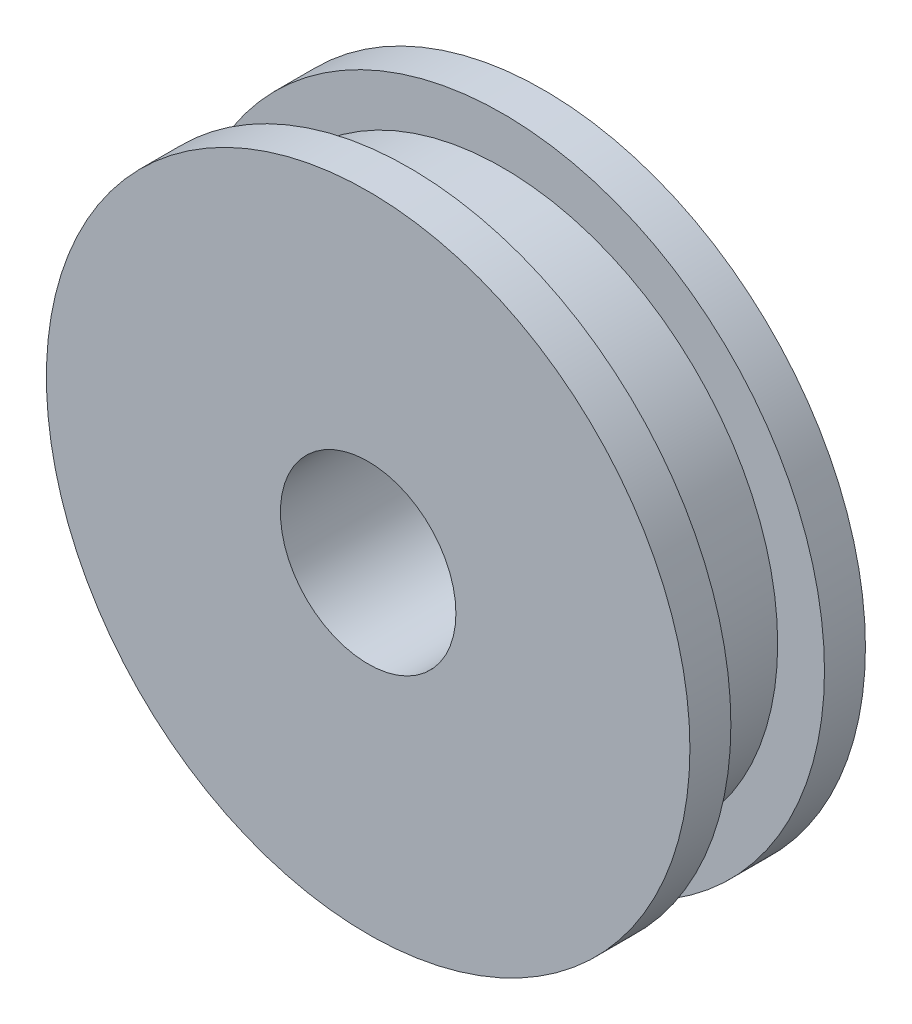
from build123d import *

# Parameters (mm, degrees)
ESBO_O1_R                = 5.5
RESSALTO_EXTRUS_O1_DEPTH = 1.5
ESBO_O3_R                = 1.5
CORTE_EXTRUS_O2_DEPTH    = 9.336666
ESBO_O5_W                = 0.8
ESBO_O5_H                = 1.6


with BuildPart() as part:
    # Esbo_o1 → Ressalto-extrus_o1 (new, symmetric)
    with BuildSketch(Plane.XY):
        Circle(ESBO_O1_R)
    extrude(amount=RESSALTO_EXTRUS_O1_DEPTH, both=True)

    # Esbo_o3 → Corte-extrus_o2 (cut, through all)
    with BuildSketch(Plane.XY.offset(1.5)):
        Circle(ESBO_O3_R)
    extrude(amount=-CORTE_EXTRUS_O2_DEPTH, mode=Mode.SUBTRACT)

    # Esbo_o5 → Corte-Revolu_o1 (revolve, cut)
    with BuildSketch(Plane(origin=(0, 0, 0), x_dir=(1, 0, 0), z_dir=(0, 1, 0))):
        with Locations((5.1, 0)):
            Rectangle(ESBO_O5_W, ESBO_O5_H)
    revolve(axis=Axis((0, 0, 1.5), (0, 0, -1)), mode=Mode.SUBTRACT)


solid = part.part
